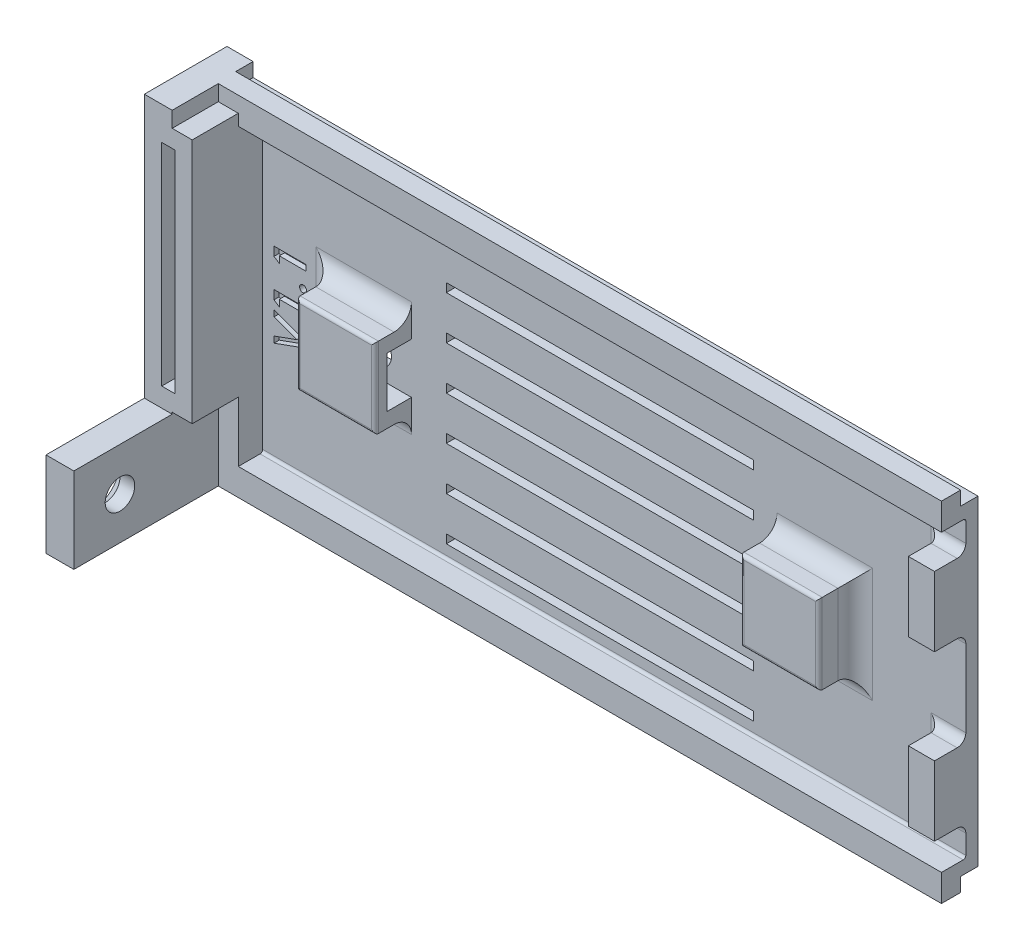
from build123d import *

# Parameters (mm, degrees)
SKETCH1_W                                       = 84.1
SKETCH1_H                                       = 40.05
BOSS_EXTRUDE1_DEPTH                             = 1.4
SKETCH5_W                                       = 2.2
SKETCH5_H                                       = 40.05
BOSS_EXTRUDE3_DEPTH                             = 9.5
SKETCH7_W                                       = 35.3
SKETCH7_H                                       = 1
CUT_EXTRUDE1_DEPTH                              = 2
SKETCH11_W                                      = 86.3
SKETCH11_H                                      = 3.1
BOSS_EXTRUDE4_DEPTH                             = 2.8
SKETCH9_W                                       = 86.3
SKETCH9_H                                       = 1.6
CUT_EXTRUDE4_DEPTH                              = 2
BOSS_EXTRUDE7_REACH                             = 78.385
SKETCH18_W                                      = 3.5
SKETCH18_H                                      = 40.05
FILLET2_R                                       = 0.3
SKETCH23_W                                      = 2.3
SKETCH23_H                                      = 1.8
SKETCH23_H_2                                    = 10
CUT_EXTRUDE11_DEPTH                             = 5.3
SKETCH26_W                                      = 3.5
SKETCH26_H                                      = 1.6
CUT_EXTRUDE12_DEPTH                             = 0.6
SKETCH30_W                                      = 1.5
SKETCH30_H                                      = 24.25
CUT_EXTRUDE16_DEPTH                             = 8.1
SKETCH34_W                                      = 3
SKETCH34_H                                      = 8
BOSS_EXTRUDE9_DEPTH                             = 3.6
FILLET4_R                                       = 1
SKETCH36_W                                      = 2
SKETCH36_H                                      = 1.6
BOSS_EXTRUDE11_DEPTH                            = 3
SKETCH37_W                                      = 3.2
SKETCH37_H                                      = 9.8
BOSS_EXTRUDE12_DEPTH                            = 11.3
SKETCH38_R                                      = 1.7
CUT_EXTRUDE19_DEPTH                             = 5
CSK_FOR_M3_FLAT_HEAD_MACHINE_SCREW2_D           = 3.4
CSK_FOR_M3_FLAT_HEAD_MACHINE_SCREW2_DEPTH       = 14
CSK_FOR_M3_FLAT_HEAD_MACHINE_SCREW2_CSINK_D     = 6.4
CSK_FOR_M3_FLAT_HEAD_MACHINE_SCREW2_CSINK_ANGLE = 90
CSK_FOR_M3_FLAT_HEAD_MACHINE_SCREW2_TIP         = 1.021463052
CUT_EXTRUDE20_DEPTH                             = 0.6
SKETCH31_R                                      = 1.7
CUT_EXTRUDE23_DEPTH                             = 2
SKETCH33_W                                      = 9
SKETCH33_H                                      = 9.2
BOSS_EXTRUDE15_DEPTH                            = 4.6
SKETCH42_W                                      = 8.4
SKETCH42_H                                      = 5.8
CUT_EXTRUDE24_DEPTH                             = 2.8
CUT_EXTRUDE25_START                             = -2.8
SKETCH43_R                                      = 1.7
CUT_EXTRUDE25_DEPTH                             = 2.8
FILLET5_R                                       = 2
FILLET6_R                                       = 0.4


with BuildPart() as part:
    # Sketch1 → Boss-Extrude1 (new body)
    with BuildSketch(Plane.XY):
        with Locations((26.3, -13.1)):
            Rectangle(SKETCH1_W, SKETCH1_H)
    extrude(amount=BOSS_EXTRUDE1_DEPTH)

    # Sketch5 → Boss-Extrude3 (add)
    with BuildSketch(Plane.XY):
        with Locations((-16.85, -13.1)):
            Rectangle(SKETCH5_W, SKETCH5_H)
    extrude(amount=BOSS_EXTRUDE3_DEPTH)

    # Sketch7 → Cut-Extrude1 (cut)
    with BuildSketch(Plane.XY):
        with Locations((26.3, -3.075)):
            Rectangle(SKETCH7_W, SKETCH7_H)
        with Locations((26.3, 1.925)):
            Rectangle(SKETCH7_W, SKETCH7_H)
        with Locations((26.3, -18.075)):
            Rectangle(SKETCH7_W, SKETCH7_H)
        with Locations((26.3, -8.075)):
            Rectangle(SKETCH7_W, SKETCH7_H)
        with Locations((26.3, -13.075)):
            Rectangle(SKETCH7_W, SKETCH7_H)
        with Locations((26.3, -28.075)):
            Rectangle(SKETCH7_W, SKETCH7_H)
        with Locations((26.3, -23.075)):
            Rectangle(SKETCH7_W, SKETCH7_H)
    extrude(amount=CUT_EXTRUDE1_DEPTH, mode=Mode.SUBTRACT)

    # Sketch11 → Boss-Extrude4 (add)
    with BuildSketch(Plane.XY.offset(1.4)):
        with Locations((25.2, -31.575)):
            Rectangle(SKETCH11_W, SKETCH11_H)
        with Locations((25.2, 5.375)):
            Rectangle(SKETCH11_W, SKETCH11_H)
    extrude(amount=BOSS_EXTRUDE4_DEPTH)

    # Sketch9 → Cut-Extrude4 (cut)
    with BuildSketch(Plane.XY):
        with Locations((25.2, -32.325)):
            Rectangle(SKETCH9_W, SKETCH9_H)
        with Locations((25.2, 6.125)):
            Rectangle(SKETCH9_W, SKETCH9_H)
    extrude(amount=CUT_EXTRUDE4_DEPTH, mode=Mode.SUBTRACT)

    # Boss-Extrude7: up to this face of the body (flat: up to its plane)
    boss_extrude7_end = Plane(part.part.faces().sort_by_distance((-16.85, -13.1, 9.5))[0])
    # Sketch18 → Boss-Extrude7 (add, up to the picked face)
    with BuildSketch(Plane.XY.offset(1.4), mode=Mode.PRIVATE) as boss_extrude7_sk1:
        with Locations((-14.2, -13.1)):
            Rectangle(SKETCH18_W, SKETCH18_H)
    boss_extrude7_tool1 = split(extrude(boss_extrude7_sk1.sketch, amount=BOSS_EXTRUDE7_REACH, mode=Mode.PRIVATE), bisect_by=boss_extrude7_end, keep=Keep.BOTH, mode=Mode.PRIVATE)
    add(boss_extrude7_tool1.solids().sort_by(Axis((-14.2, -13.1, 1.4), (0, 0, 1)))[0])

    # Fillet2
    fillet2_edges = [part.edges().sort_by_distance(p)[0] for p in [
        (27.95, -30.025, 1.4),
        (27.95, 3.825, 1.4),
    ]]
    fillet(fillet2_edges, radius=FILLET2_R)

    # Sketch23 → Cut-Extrude11 (cut)
    with BuildSketch(Plane.XY.offset(9.5)):
        with Locations((-13.6, 6.025)):
            Rectangle(SKETCH23_W, SKETCH23_H)
        with Locations((-13.6, -28.125)):
            Rectangle(SKETCH23_W, SKETCH23_H_2)
    extrude(amount=-CUT_EXTRUDE11_DEPTH, mode=Mode.SUBTRACT)

    # Sketch26 → Cut-Extrude12 (cut)
    with BuildSketch(Plane.XY.offset(1.4)):
        with Locations((-14.2, 6.125)):
            Rectangle(SKETCH26_W, SKETCH26_H)
        with Locations((-14.2, -32.325)):
            Rectangle(SKETCH26_W, SKETCH26_H)
    extrude(amount=CUT_EXTRUDE12_DEPTH, mode=Mode.SUBTRACT)

    # Sketch30 → Cut-Extrude16 (cut)
    with BuildSketch(Plane.XY.offset(9.5)):
        with Locations((-15.2, -9)):
            Rectangle(SKETCH30_W, SKETCH30_H)
    extrude(amount=-CUT_EXTRUDE16_DEPTH, mode=Mode.SUBTRACT)

    # Sketch34 → Boss-Extrude9 (add)
    with BuildSketch(Plane.XY.offset(1.4)):
        with Locations((66.85, -22.525)):
            Rectangle(SKETCH34_W, SKETCH34_H)
        with Locations((66.85, -3.675)):
            Rectangle(SKETCH34_W, SKETCH34_H)
    extrude(amount=BOSS_EXTRUDE9_DEPTH)

    # Fillet4
    fillet4_edges = [part.edges().sort_by_distance(p)[0] for p in [
        (66.85, -18.525, 1.4),
        (65.35, -22.525, 1.4),
        (66.85, -26.525, 1.4),
        (66.85, 0.325, 1.4),
        (65.35, -3.675, 1.4),
        (66.85, -7.675, 1.4),
    ]]
    fillet(fillet4_edges, radius=FILLET4_R)

    # Sketch36 → Boss-Extrude11 (add)
    with BuildSketch(Plane.ZY.offset(17.95)):
        with Locations((1, 6.125)):
            Rectangle(SKETCH36_W, SKETCH36_H)
        with Locations((1, -32.325)):
            Rectangle(SKETCH36_W, SKETCH36_H)
    extrude(amount=-BOSS_EXTRUDE11_DEPTH)

    # Sketch37 → Boss-Extrude12 (add)
    with BuildSketch(Plane.XY.offset(9.5)):
        with Locations((-16.35, -28.225)):
            Rectangle(SKETCH37_W, SKETCH37_H)
    extrude(amount=BOSS_EXTRUDE12_DEPTH)

    # Sketch38 → Cut-Extrude19 (cut)
    with BuildSketch(Plane.ZY.offset(17.95)):
        with Locations(Location((15.5, -28.275, 0), (0, 0, 270))):
            Circle(SKETCH38_R)
    extrude(amount=-CUT_EXTRUDE19_DEPTH, mode=Mode.SUBTRACT)

    # CSK for M3 Flat Head Machine Screw2
    with Locations(Plane.ZY.offset(17.95)):
        with Locations((15.5, -28.275)):
            CounterSinkHole(CSK_FOR_M3_FLAT_HEAD_MACHINE_SCREW2_D / 2, CSK_FOR_M3_FLAT_HEAD_MACHINE_SCREW2_CSINK_D / 2, depth=CSK_FOR_M3_FLAT_HEAD_MACHINE_SCREW2_DEPTH, counter_sink_angle=CSK_FOR_M3_FLAT_HEAD_MACHINE_SCREW2_CSINK_ANGLE)
            with Locations((0, 0, -(CSK_FOR_M3_FLAT_HEAD_MACHINE_SCREW2_DEPTH + CSK_FOR_M3_FLAT_HEAD_MACHINE_SCREW2_TIP / 2))):  # 118° drill point
                Cone(0, CSK_FOR_M3_FLAT_HEAD_MACHINE_SCREW2_D / 2, CSK_FOR_M3_FLAT_HEAD_MACHINE_SCREW2_TIP, mode=Mode.SUBTRACT)

    # Sketch41 → Cut-Extrude20 (cut)
    with BuildSketch(Plane.XY.offset(1.4)):
        Polygon((-11.154166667, -18.506276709), (-11.154166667, -17.796163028), (-8.522961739, -16.844150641), (-11.154166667, -15.889912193), (-11.154166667, -15.182024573), (-7.45, -16.525081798), (-7.45, -17.165445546), align=None)
        Polygon((-11.154166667, -14.191427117), (-11.154166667, -13.163728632), (-7.45, -13.163728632), (-7.45, -13.82857906), (-10.536805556, -13.82857906), (-10.536805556, -14.58840812), align=None)
        with BuildLine():
            add(Edge.make_bspline(
                [(-8.20982906, -11.43036859), (-8.208454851, -11.403496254), (-8.20574572, -11.350519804), (-8.182716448, -11.274696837), (-8.145212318, -11.205197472), (-8.094244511, -11.143861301), (-8.033385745, -11.091715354), (-7.963841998, -11.054073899), (-7.88779384, -11.030622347), (-7.834784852, -11.028034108), (-7.807653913, -11.026709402)],
                knots=[0, 0, 0, 0, 1.01719242, 2.005305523, 2.97459142, 3.994072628, 5.012345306, 5.994342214, 6.97346883, 8, 8, 8, 8], degree=3))
            add(Edge.make_bspline(
                [(-7.807653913, -11.026709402), (-7.780533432, -11.028066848), (-7.727307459, -11.030730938), (-7.650894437, -11.053873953), (-7.581103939, -11.091932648), (-7.519580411, -11.143792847), (-7.467978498, -11.205186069), (-7.429485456, -11.274494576), (-7.406638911, -11.350542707), (-7.403899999, -11.403503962), (-7.402510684, -11.43036859)],
                knots=[0, 0, 0, 0, 1.023125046, 2.0079595, 2.986698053, 4.008755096, 5.030812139, 6.001348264, 6.986182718, 8, 8, 8, 8], degree=3))
            add(Edge.make_bspline(
                [(-7.402510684, -11.43036859), (-7.403888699, -11.457239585), (-7.406605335, -11.510213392), (-7.429678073, -11.586379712), (-7.467721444, -11.656200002), (-7.51964356, -11.717608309), (-7.580883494, -11.769701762), (-7.651119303, -11.806693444), (-7.727278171, -11.830059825), (-7.780523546, -11.832688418), (-7.807653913, -11.834027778)],
                knots=[0, 0, 0, 0, 1.013339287, 1.99770941, 2.975986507, 3.997561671, 5.019136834, 5.992987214, 6.977357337, 8, 8, 8, 8], degree=3))
            add(Edge.make_bspline(
                [(-7.807653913, -11.834027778), (-7.834794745, -11.832721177), (-7.887823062, -11.830168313), (-7.963618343, -11.806495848), (-8.033604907, -11.769916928), (-8.094182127, -11.71754092), (-8.145467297, -11.65618476), (-8.182524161, -11.586180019), (-8.205779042, -11.510235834), (-8.208466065, -11.457247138), (-8.20982906, -11.43036859)],
                knots=[0, 0, 0, 0, 1.026040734, 2.004699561, 2.981785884, 3.999572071, 5.018566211, 5.995652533, 6.983293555, 8, 8, 8, 8], degree=3))
        make_face()
        Polygon((-11.154166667, -9.869899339), (-11.154166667, -8.842200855), (-7.45, -8.842200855), (-7.45, -9.507051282), (-10.536805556, -9.507051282), (-10.536805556, -10.266880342), align=None)
    extrude(amount=-CUT_EXTRUDE20_DEPTH, mode=Mode.SUBTRACT)

    # Sketch31 → Cut-Extrude23 (cut)
    with BuildSketch(Plane.XY):
        with Locations((0.65, -13.1)):
            Circle(SKETCH31_R)
        with Locations((50.65, -13.1)):
            Circle(SKETCH31_R)
    extrude(amount=CUT_EXTRUDE23_DEPTH, mode=Mode.SUBTRACT)

    # Sketch33 → Boss-Extrude15 (add)
    with BuildSketch(Plane(origin=(0, 0, 1), x_dir=(-1, 0, 0), z_dir=(0, 0, -1))):
        with Locations((-0.15, -13.1)):
            Rectangle(SKETCH33_W, SKETCH33_H)
        with Locations((-51.15, -13.1)):
            Rectangle(SKETCH33_W, SKETCH33_H)
    extrude(amount=-BOSS_EXTRUDE15_DEPTH)

    # Sketch42 → Cut-Extrude24 (cut)
    with BuildSketch(Plane.XY.offset(1.4)):
        with Locations((1.45, -13.1)):
            Rectangle(SKETCH42_W, SKETCH42_H)
        with Locations((49.85, -13.1)):
            Rectangle(SKETCH42_W, SKETCH42_H)
    extrude(amount=CUT_EXTRUDE24_DEPTH, mode=Mode.SUBTRACT)

    # Sketch43 → Cut-Extrude25 (cut)
    with BuildSketch(Plane.XY.offset(1.4).offset(CUT_EXTRUDE25_START)):
        with Locations((50.65, -13.1)):
            Circle(SKETCH43_R)
        with Locations((0.65, -13.1)):
            Circle(SKETCH43_R)
    extrude(amount=CUT_EXTRUDE25_DEPTH, mode=Mode.SUBTRACT)

    # Fillet5
    fillet5_edges = [part.edges().sort_by_distance(p)[0] for p in [
        (0.15, -8.5, 1.4),
        (0.15, -17.7, 1.4),
        (-4.35, -13.1, 1.4),
        (51.15, -8.5, 1.4),
        (55.65, -13.1, 1.4),
        (51.15, -17.7, 1.4),
    ]]
    fillet(fillet5_edges, radius=FILLET5_R)

    # Fillet6
    fillet6_edges = [part.edges().sort_by_distance(p)[0] for p in [
        (-4.35, -13.1, 5.6),
        (0.15, -17.7, 5.6),
        (4.65, -13.1, 5.6),
        (0.15, -8.5, 5.6),
        (46.65, -13.1, 5.6),
        (51.15, -17.7, 5.6),
        (55.65, -13.1, 5.6),
        (51.15, -8.5, 5.6),
    ]]
    fillet(fillet6_edges, radius=FILLET6_R)


solid = part.part
